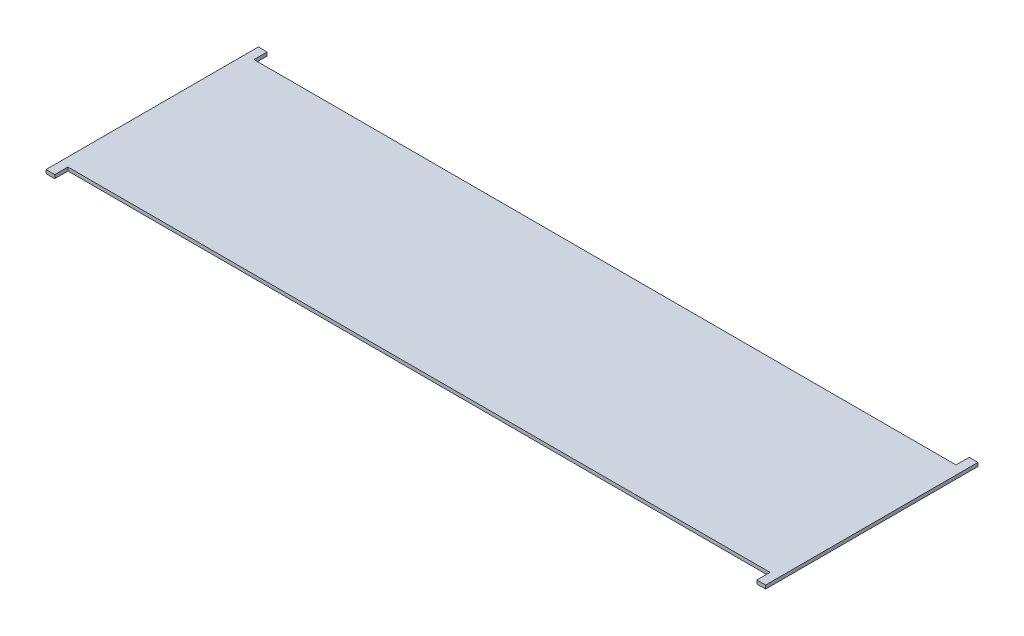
ISO-10303-21;
HEADER;
FILE_DESCRIPTION(('STEP AP214'),'2;1');
FILE_NAME('part.step','',(''),(''),'','','');
FILE_SCHEMA(('AUTOMOTIVE_DESIGN { 1 0 10303 214 1 1 1 1 }'));
ENDSEC;
DATA;
#1=APPLICATION_CONTEXT('core data for automotive mechanical design processes');
#2=APPLICATION_PROTOCOL_DEFINITION('international standard','automotive_design',2000,#1);
#3=PRODUCT_CONTEXT('',#1,'mechanical');
#4=PRODUCT('Part','Part','',(#3));
#5=PRODUCT_RELATED_PRODUCT_CATEGORY('part','',(#4));
#6=PRODUCT_DEFINITION_FORMATION('','',#4);
#7=PRODUCT_DEFINITION_CONTEXT('part definition',#1,'design');
#8=PRODUCT_DEFINITION('design','',#6,#7);
#9=PRODUCT_DEFINITION_SHAPE('','',#8);
#10=(LENGTH_UNIT() NAMED_UNIT(*) SI_UNIT(.MILLI.,.METRE.));
#11=(NAMED_UNIT(*) PLANE_ANGLE_UNIT() SI_UNIT($,.RADIAN.));
#12=(NAMED_UNIT(*) SI_UNIT($,.STERADIAN.) SOLID_ANGLE_UNIT());
#13=UNCERTAINTY_MEASURE_WITH_UNIT(LENGTH_MEASURE(1.E-05),#10,'distance_accuracy_value','');
#14=(GEOMETRIC_REPRESENTATION_CONTEXT(3) GLOBAL_UNCERTAINTY_ASSIGNED_CONTEXT((#13)) GLOBAL_UNIT_ASSIGNED_CONTEXT((#10,
#11,#12)) REPRESENTATION_CONTEXT('',''));
#15=CARTESIAN_POINT('',(0.,0.,0.));
#16=DIRECTION('',(0.,0.,1.));
#17=DIRECTION('',(1.,0.,0.));
#18=AXIS2_PLACEMENT_3D('',#15,#16,#17);
#19=CARTESIAN_POINT('',(0.,-1.,-212.));
#20=DIRECTION('',(0.,0.,-1.));
#21=DIRECTION('',(-1.,0.,0.));
#22=AXIS2_PLACEMENT_3D('',#19,#20,#21);
#23=PLANE('',#22);
#24=DIRECTION('',(-1.,0.,0.));
#25=VECTOR('',#24,1.);
#26=CARTESIAN_POINT('',(0.,3.,-212.));
#27=LINE('',#26,#25);
#28=CARTESIAN_POINT('',(800.,3.,-212.));
#29=VERTEX_POINT('',#28);
#30=CARTESIAN_POINT('',(0.,3.,-212.));
#31=VERTEX_POINT('',#30);
#32=EDGE_CURVE('E311',#29,#31,#27,.T.);
#33=ORIENTED_EDGE('',*,*,#32,.F.);
#34=DIRECTION('',(0.,1.,0.));
#35=VECTOR('',#34,1.);
#36=CARTESIAN_POINT('',(800.,-1.,-212.));
#37=LINE('',#36,#35);
#38=CARTESIAN_POINT('',(800.,-1.,-212.));
#39=VERTEX_POINT('',#38);
#40=EDGE_CURVE('E356',#39,#29,#37,.T.);
#41=ORIENTED_EDGE('',*,*,#40,.F.);
#42=DIRECTION('',(-1.,0.,0.));
#43=VECTOR('',#42,1.);
#44=CARTESIAN_POINT('',(0.,-1.,-212.));
#45=LINE('',#44,#43);
#46=CARTESIAN_POINT('',(0.,-1.,-212.));
#47=VERTEX_POINT('',#46);
#48=EDGE_CURVE('E335',#39,#47,#45,.T.);
#49=ORIENTED_EDGE('',*,*,#48,.T.);
#50=DIRECTION('',(0.,1.,0.));
#51=VECTOR('',#50,1.);
#52=CARTESIAN_POINT('',(0.,-1.,-212.));
#53=LINE('',#52,#51);
#54=EDGE_CURVE('E354',#47,#31,#53,.T.);
#55=ORIENTED_EDGE('',*,*,#54,.T.);
#56=EDGE_LOOP('',(#33,#41,#49,#55));
#57=FACE_BOUND('',#56,.T.);
#58=ADVANCED_FACE('F181',(#57),#23,.T.);
#59=CARTESIAN_POINT('',(0.,-1.,0.));
#60=DIRECTION('',(0.,0.,1.));
#61=DIRECTION('',(1.,0.,0.));
#62=AXIS2_PLACEMENT_3D('',#59,#60,#61);
#63=PLANE('',#62);
#64=DIRECTION('',(1.,0.,0.));
#65=VECTOR('',#64,1.);
#66=CARTESIAN_POINT('',(0.,3.,0.));
#67=LINE('',#66,#65);
#68=CARTESIAN_POINT('',(0.,3.,0.));
#69=VERTEX_POINT('',#68);
#70=CARTESIAN_POINT('',(800.,3.,0.));
#71=VERTEX_POINT('',#70);
#72=EDGE_CURVE('E324',#69,#71,#67,.T.);
#73=ORIENTED_EDGE('',*,*,#72,.F.);
#74=DIRECTION('',(0.,1.,0.));
#75=VECTOR('',#74,1.);
#76=CARTESIAN_POINT('',(0.,-1.,0.));
#77=LINE('',#76,#75);
#78=CARTESIAN_POINT('',(0.,-1.,0.));
#79=VERTEX_POINT('',#78);
#80=EDGE_CURVE('E191',#79,#69,#77,.T.);
#81=ORIENTED_EDGE('',*,*,#80,.F.);
#82=DIRECTION('',(1.,0.,0.));
#83=VECTOR('',#82,1.);
#84=CARTESIAN_POINT('',(0.,-1.,0.));
#85=LINE('',#84,#83);
#86=CARTESIAN_POINT('',(800.,-1.,0.));
#87=VERTEX_POINT('',#86);
#88=EDGE_CURVE('E282',#79,#87,#85,.T.);
#89=ORIENTED_EDGE('',*,*,#88,.T.);
#90=DIRECTION('',(0.,1.,0.));
#91=VECTOR('',#90,1.);
#92=CARTESIAN_POINT('',(800.,-1.,0.));
#93=LINE('',#92,#91);
#94=EDGE_CURVE('E12',#87,#71,#93,.T.);
#95=ORIENTED_EDGE('',*,*,#94,.T.);
#96=EDGE_LOOP('',(#73,#81,#89,#95));
#97=FACE_BOUND('',#96,.T.);
#98=ADVANCED_FACE('F415',(#97),#63,.T.);
#99=CARTESIAN_POINT('',(800.,-1.,0.));
#100=DIRECTION('',(1.,0.,0.));
#101=DIRECTION('',(0.,0.,-1.));
#102=AXIS2_PLACEMENT_3D('',#99,#100,#101);
#103=PLANE('',#102);
#104=DIRECTION('',(0.,0.,-1.));
#105=VECTOR('',#104,1.);
#106=CARTESIAN_POINT('',(800.,3.,0.));
#107=LINE('',#106,#105);
#108=CARTESIAN_POINT('',(800.,3.,-227.));
#109=VERTEX_POINT('',#108);
#110=EDGE_CURVE('E309',#29,#109,#107,.T.);
#111=ORIENTED_EDGE('',*,*,#110,.T.);
#112=DIRECTION('',(0.,1.,0.));
#113=VECTOR('',#112,1.);
#114=CARTESIAN_POINT('',(800.,-1.,-227.));
#115=LINE('',#114,#113);
#116=CARTESIAN_POINT('',(800.,-1.,-227.));
#117=VERTEX_POINT('',#116);
#118=EDGE_CURVE('E365',#117,#109,#115,.T.);
#119=ORIENTED_EDGE('',*,*,#118,.F.);
#120=DIRECTION('',(0.,0.,-1.));
#121=VECTOR('',#120,1.);
#122=CARTESIAN_POINT('',(800.,-1.,0.));
#123=LINE('',#122,#121);
#124=EDGE_CURVE('E339',#39,#117,#123,.T.);
#125=ORIENTED_EDGE('',*,*,#124,.F.);
#126=ORIENTED_EDGE('',*,*,#40,.T.);
#127=EDGE_LOOP('',(#111,#119,#125,#126));
#128=FACE_BOUND('',#127,.T.);
#129=ADVANCED_FACE('F406',(#128),#103,.F.);
#130=CARTESIAN_POINT('',(0.,-1.,-227.));
#131=DIRECTION('',(0.,0.,1.));
#132=DIRECTION('',(1.,0.,0.));
#133=AXIS2_PLACEMENT_3D('',#130,#131,#132);
#134=PLANE('',#133);
#135=DIRECTION('',(1.,0.,0.));
#136=VECTOR('',#135,1.);
#137=CARTESIAN_POINT('',(0.,3.,-227.));
#138=LINE('',#137,#136);
#139=CARTESIAN_POINT('',(810.,3.,-227.));
#140=VERTEX_POINT('',#139);
#141=EDGE_CURVE('E307',#109,#140,#138,.T.);
#142=ORIENTED_EDGE('',*,*,#141,.T.);
#143=DIRECTION('',(0.,1.,0.));
#144=VECTOR('',#143,1.);
#145=CARTESIAN_POINT('',(810.,-1.,-227.));
#146=LINE('',#145,#144);
#147=CARTESIAN_POINT('',(810.,-1.,-227.));
#148=VERTEX_POINT('',#147);
#149=EDGE_CURVE('E350',#148,#140,#146,.T.);
#150=ORIENTED_EDGE('',*,*,#149,.F.);
#151=DIRECTION('',(1.,0.,0.));
#152=VECTOR('',#151,1.);
#153=CARTESIAN_POINT('',(0.,-1.,-227.));
#154=LINE('',#153,#152);
#155=EDGE_CURVE('E390',#117,#148,#154,.T.);
#156=ORIENTED_EDGE('',*,*,#155,.F.);
#157=ORIENTED_EDGE('',*,*,#118,.T.);
#158=EDGE_LOOP('',(#142,#150,#156,#157));
#159=FACE_BOUND('',#158,.T.);
#160=ADVANCED_FACE('F407',(#159),#134,.F.);
#161=CARTESIAN_POINT('',(810.,-1.,0.));
#162=DIRECTION('',(-1.,0.,0.));
#163=DIRECTION('',(0.,0.,1.));
#164=AXIS2_PLACEMENT_3D('',#161,#162,#163);
#165=PLANE('',#164);
#166=DIRECTION('',(0.,0.,1.));
#167=VECTOR('',#166,1.);
#168=CARTESIAN_POINT('',(810.,3.,0.));
#169=LINE('',#168,#167);
#170=CARTESIAN_POINT('',(810.,3.,15.));
#171=VERTEX_POINT('',#170);
#172=EDGE_CURVE('E305',#140,#171,#169,.T.);
#173=ORIENTED_EDGE('',*,*,#172,.T.);
#174=DIRECTION('',(0.,1.,0.));
#175=VECTOR('',#174,1.);
#176=CARTESIAN_POINT('',(810.,-1.,15.));
#177=LINE('',#176,#175);
#178=CARTESIAN_POINT('',(810.,-1.,15.));
#179=VERTEX_POINT('',#178);
#180=EDGE_CURVE('E345',#179,#171,#177,.T.);
#181=ORIENTED_EDGE('',*,*,#180,.F.);
#182=DIRECTION('',(0.,0.,1.));
#183=VECTOR('',#182,1.);
#184=CARTESIAN_POINT('',(810.,-1.,0.));
#185=LINE('',#184,#183);
#186=EDGE_CURVE('E380',#148,#179,#185,.T.);
#187=ORIENTED_EDGE('',*,*,#186,.F.);
#188=ORIENTED_EDGE('',*,*,#149,.T.);
#189=EDGE_LOOP('',(#173,#181,#187,#188));
#190=FACE_BOUND('',#189,.T.);
#191=ADVANCED_FACE('F378',(#190),#165,.F.);
#192=CARTESIAN_POINT('',(0.,-1.,15.));
#193=DIRECTION('',(0.,0.,-1.));
#194=DIRECTION('',(-1.,0.,0.));
#195=AXIS2_PLACEMENT_3D('',#192,#193,#194);
#196=PLANE('',#195);
#197=DIRECTION('',(-1.,0.,0.));
#198=VECTOR('',#197,1.);
#199=CARTESIAN_POINT('',(0.,3.,15.));
#200=LINE('',#199,#198);
#201=CARTESIAN_POINT('',(800.,3.,15.));
#202=VERTEX_POINT('',#201);
#203=EDGE_CURVE('E303',#171,#202,#200,.T.);
#204=ORIENTED_EDGE('',*,*,#203,.T.);
#205=DIRECTION('',(0.,1.,0.));
#206=VECTOR('',#205,1.);
#207=CARTESIAN_POINT('',(800.,-1.,15.));
#208=LINE('',#207,#206);
#209=CARTESIAN_POINT('',(800.,-1.,15.));
#210=VERTEX_POINT('',#209);
#211=EDGE_CURVE('E343',#210,#202,#208,.T.);
#212=ORIENTED_EDGE('',*,*,#211,.F.);
#213=DIRECTION('',(-1.,0.,0.));
#214=VECTOR('',#213,1.);
#215=CARTESIAN_POINT('',(0.,-1.,15.));
#216=LINE('',#215,#214);
#217=EDGE_CURVE('E250',#179,#210,#216,.T.);
#218=ORIENTED_EDGE('',*,*,#217,.F.);
#219=ORIENTED_EDGE('',*,*,#180,.T.);
#220=EDGE_LOOP('',(#204,#212,#218,#219));
#221=FACE_BOUND('',#220,.T.);
#222=ADVANCED_FACE('F388',(#221),#196,.F.);
#223=CARTESIAN_POINT('',(800.,-1.,0.));
#224=DIRECTION('',(1.,0.,0.));
#225=DIRECTION('',(0.,0.,-1.));
#226=AXIS2_PLACEMENT_3D('',#223,#224,#225);
#227=PLANE('',#226);
#228=DIRECTION('',(0.,0.,-1.));
#229=VECTOR('',#228,1.);
#230=CARTESIAN_POINT('',(800.,3.,0.));
#231=LINE('',#230,#229);
#232=EDGE_CURVE('E301',#202,#71,#231,.T.);
#233=ORIENTED_EDGE('',*,*,#232,.T.);
#234=ORIENTED_EDGE('',*,*,#94,.F.);
#235=DIRECTION('',(0.,0.,-1.));
#236=VECTOR('',#235,1.);
#237=CARTESIAN_POINT('',(800.,-1.,0.));
#238=LINE('',#237,#236);
#239=EDGE_CURVE('E200',#210,#87,#238,.T.);
#240=ORIENTED_EDGE('',*,*,#239,.F.);
#241=ORIENTED_EDGE('',*,*,#211,.T.);
#242=EDGE_LOOP('',(#233,#234,#240,#241));
#243=FACE_BOUND('',#242,.T.);
#244=ADVANCED_FACE('F183',(#243),#227,.F.);
#245=CARTESIAN_POINT('',(0.,3.,0.));
#246=DIRECTION('',(0.,1.,0.));
#247=DIRECTION('',(0.,0.,1.));
#248=AXIS2_PLACEMENT_3D('',#245,#246,#247);
#249=PLANE('',#248);
#250=DIRECTION('',(0.,0.,1.));
#251=VECTOR('',#250,1.);
#252=CARTESIAN_POINT('',(0.,3.,0.));
#253=LINE('',#252,#251);
#254=CARTESIAN_POINT('',(0.,3.,15.));
#255=VERTEX_POINT('',#254);
#256=EDGE_CURVE('E287',#69,#255,#253,.T.);
#257=ORIENTED_EDGE('',*,*,#256,.F.);
#258=ORIENTED_EDGE('',*,*,#72,.T.);
#259=ORIENTED_EDGE('',*,*,#232,.F.);
#260=ORIENTED_EDGE('',*,*,#203,.F.);
#261=ORIENTED_EDGE('',*,*,#172,.F.);
#262=ORIENTED_EDGE('',*,*,#141,.F.);
#263=ORIENTED_EDGE('',*,*,#110,.F.);
#264=ORIENTED_EDGE('',*,*,#32,.T.);
#265=CARTESIAN_POINT('',(0.,3.,-227.));
#266=VERTEX_POINT('',#265);
#267=EDGE_CURVE('E318',#266,#31,#253,.T.);
#268=ORIENTED_EDGE('',*,*,#267,.F.);
#269=DIRECTION('',(-1.,0.,0.));
#270=VECTOR('',#269,1.);
#271=CARTESIAN_POINT('',(0.,3.,-227.));
#272=LINE('',#271,#270);
#273=CARTESIAN_POINT('',(-10.,3.,-227.));
#274=VERTEX_POINT('',#273);
#275=EDGE_CURVE('E314',#266,#274,#272,.T.);
#276=ORIENTED_EDGE('',*,*,#275,.T.);
#277=DIRECTION('',(0.,0.,1.));
#278=VECTOR('',#277,1.);
#279=CARTESIAN_POINT('',(-10.,3.,0.));
#280=LINE('',#279,#278);
#281=CARTESIAN_POINT('',(-10.,3.,15.));
#282=VERTEX_POINT('',#281);
#283=EDGE_CURVE('E572',#274,#282,#280,.T.);
#284=ORIENTED_EDGE('',*,*,#283,.T.);
#285=DIRECTION('',(-1.,0.,0.));
#286=VECTOR('',#285,1.);
#287=CARTESIAN_POINT('',(0.,3.,15.));
#288=LINE('',#287,#286);
#289=EDGE_CURVE('E325',#255,#282,#288,.T.);
#290=ORIENTED_EDGE('',*,*,#289,.F.);
#291=EDGE_LOOP('',(#257,#258,#259,#260,#261,#262,#263,#264,#268,#276,#284,#290));
#292=FACE_BOUND('',#291,.T.);
#293=ADVANCED_FACE('F386',(#292),#249,.T.);
#294=CARTESIAN_POINT('',(0.,-1.,0.));
#295=DIRECTION('',(-1.,0.,0.));
#296=DIRECTION('',(0.,0.,1.));
#297=AXIS2_PLACEMENT_3D('',#294,#295,#296);
#298=PLANE('',#297);
#299=ORIENTED_EDGE('',*,*,#267,.T.);
#300=ORIENTED_EDGE('',*,*,#54,.F.);
#301=DIRECTION('',(0.,0.,1.));
#302=VECTOR('',#301,1.);
#303=CARTESIAN_POINT('',(0.,-1.,0.));
#304=LINE('',#303,#302);
#305=CARTESIAN_POINT('',(0.,-1.,-227.));
#306=VERTEX_POINT('',#305);
#307=EDGE_CURVE('E332',#306,#47,#304,.T.);
#308=ORIENTED_EDGE('',*,*,#307,.F.);
#309=DIRECTION('',(0.,1.,0.));
#310=VECTOR('',#309,1.);
#311=CARTESIAN_POINT('',(0.,-1.,-227.));
#312=LINE('',#311,#310);
#313=EDGE_CURVE('E355',#306,#266,#312,.T.);
#314=ORIENTED_EDGE('',*,*,#313,.T.);
#315=EDGE_LOOP('',(#299,#300,#308,#314));
#316=FACE_BOUND('',#315,.T.);
#317=ADVANCED_FACE('F399',(#316),#298,.F.);
#318=ORIENTED_EDGE('',*,*,#256,.T.);
#319=DIRECTION('',(0.,1.,0.));
#320=VECTOR('',#319,1.);
#321=CARTESIAN_POINT('',(0.,-1.,15.));
#322=LINE('',#321,#320);
#323=CARTESIAN_POINT('',(0.,-1.,15.));
#324=VERTEX_POINT('',#323);
#325=EDGE_CURVE('E285',#324,#255,#322,.T.);
#326=ORIENTED_EDGE('',*,*,#325,.F.);
#327=EDGE_CURVE('E275',#79,#324,#304,.T.);
#328=ORIENTED_EDGE('',*,*,#327,.F.);
#329=ORIENTED_EDGE('',*,*,#80,.T.);
#330=EDGE_LOOP('',(#318,#326,#328,#329));
#331=FACE_BOUND('',#330,.T.);
#332=ADVANCED_FACE('F286',(#331),#298,.F.);
#333=CARTESIAN_POINT('',(0.,-1.,15.));
#334=DIRECTION('',(0.,0.,-1.));
#335=DIRECTION('',(-1.,0.,0.));
#336=AXIS2_PLACEMENT_3D('',#333,#334,#335);
#337=PLANE('',#336);
#338=ORIENTED_EDGE('',*,*,#289,.T.);
#339=DIRECTION('',(0.,1.,0.));
#340=VECTOR('',#339,1.);
#341=CARTESIAN_POINT('',(-10.,-1.,15.));
#342=LINE('',#341,#340);
#343=CARTESIAN_POINT('',(-10.,-1.,15.));
#344=VERTEX_POINT('',#343);
#345=EDGE_CURVE('E291',#344,#282,#342,.T.);
#346=ORIENTED_EDGE('',*,*,#345,.F.);
#347=DIRECTION('',(-1.,0.,0.));
#348=VECTOR('',#347,1.);
#349=CARTESIAN_POINT('',(0.,-1.,15.));
#350=LINE('',#349,#348);
#351=EDGE_CURVE('E280',#324,#344,#350,.T.);
#352=ORIENTED_EDGE('',*,*,#351,.F.);
#353=ORIENTED_EDGE('',*,*,#325,.T.);
#354=EDGE_LOOP('',(#338,#346,#352,#353));
#355=FACE_BOUND('',#354,.T.);
#356=ADVANCED_FACE('F293',(#355),#337,.F.);
#357=CARTESIAN_POINT('',(-10.,-1.,0.));
#358=DIRECTION('',(-1.,0.,0.));
#359=DIRECTION('',(0.,0.,1.));
#360=AXIS2_PLACEMENT_3D('',#357,#358,#359);
#361=PLANE('',#360);
#362=ORIENTED_EDGE('',*,*,#283,.F.);
#363=DIRECTION('',(0.,1.,0.));
#364=VECTOR('',#363,1.);
#365=CARTESIAN_POINT('',(-10.,-1.,-227.));
#366=LINE('',#365,#364);
#367=CARTESIAN_POINT('',(-10.,-1.,-227.));
#368=VERTEX_POINT('',#367);
#369=EDGE_CURVE('E363',#368,#274,#366,.T.);
#370=ORIENTED_EDGE('',*,*,#369,.F.);
#371=DIRECTION('',(0.,0.,1.));
#372=VECTOR('',#371,1.);
#373=CARTESIAN_POINT('',(-10.,-1.,0.));
#374=LINE('',#373,#372);
#375=EDGE_CURVE('E295',#368,#344,#374,.T.);
#376=ORIENTED_EDGE('',*,*,#375,.T.);
#377=ORIENTED_EDGE('',*,*,#345,.T.);
#378=EDGE_LOOP('',(#362,#370,#376,#377));
#379=FACE_BOUND('',#378,.T.);
#380=ADVANCED_FACE('F427',(#379),#361,.T.);
#381=CARTESIAN_POINT('',(0.,-1.,-227.));
#382=DIRECTION('',(0.,0.,-1.));
#383=DIRECTION('',(-1.,0.,0.));
#384=AXIS2_PLACEMENT_3D('',#381,#382,#383);
#385=PLANE('',#384);
#386=ORIENTED_EDGE('',*,*,#275,.F.);
#387=ORIENTED_EDGE('',*,*,#313,.F.);
#388=DIRECTION('',(-1.,0.,0.));
#389=VECTOR('',#388,1.);
#390=CARTESIAN_POINT('',(0.,-1.,-227.));
#391=LINE('',#390,#389);
#392=EDGE_CURVE('E297',#306,#368,#391,.T.);
#393=ORIENTED_EDGE('',*,*,#392,.T.);
#394=ORIENTED_EDGE('',*,*,#369,.T.);
#395=EDGE_LOOP('',(#386,#387,#393,#394));
#396=FACE_BOUND('',#395,.T.);
#397=ADVANCED_FACE('F424',(#396),#385,.T.);
#398=CARTESIAN_POINT('',(0.,-1.,0.));
#399=DIRECTION('',(0.,1.,0.));
#400=DIRECTION('',(0.,0.,1.));
#401=AXIS2_PLACEMENT_3D('',#398,#399,#400);
#402=PLANE('',#401);
#403=ORIENTED_EDGE('',*,*,#307,.T.);
#404=ORIENTED_EDGE('',*,*,#48,.F.);
#405=ORIENTED_EDGE('',*,*,#124,.T.);
#406=ORIENTED_EDGE('',*,*,#155,.T.);
#407=ORIENTED_EDGE('',*,*,#186,.T.);
#408=ORIENTED_EDGE('',*,*,#217,.T.);
#409=ORIENTED_EDGE('',*,*,#239,.T.);
#410=ORIENTED_EDGE('',*,*,#88,.F.);
#411=ORIENTED_EDGE('',*,*,#327,.T.);
#412=ORIENTED_EDGE('',*,*,#351,.T.);
#413=ORIENTED_EDGE('',*,*,#375,.F.);
#414=ORIENTED_EDGE('',*,*,#392,.F.);
#415=EDGE_LOOP('',(#403,#404,#405,#406,#407,#408,#409,#410,#411,#412,#413,#414));
#416=FACE_BOUND('',#415,.T.);
#417=ADVANCED_FACE('F277',(#416),#402,.F.);
#418=CLOSED_SHELL('',(#58,#98,#129,#160,#191,#222,#244,#293,#317,#332,#356,#380,#397,#417));
#419=MANIFOLD_SOLID_BREP('B2',#418);
#420=ADVANCED_BREP_SHAPE_REPRESENTATION('',(#18,#419),#14);
#421=SHAPE_DEFINITION_REPRESENTATION(#9,#420);
ENDSEC;
END-ISO-10303-21;
